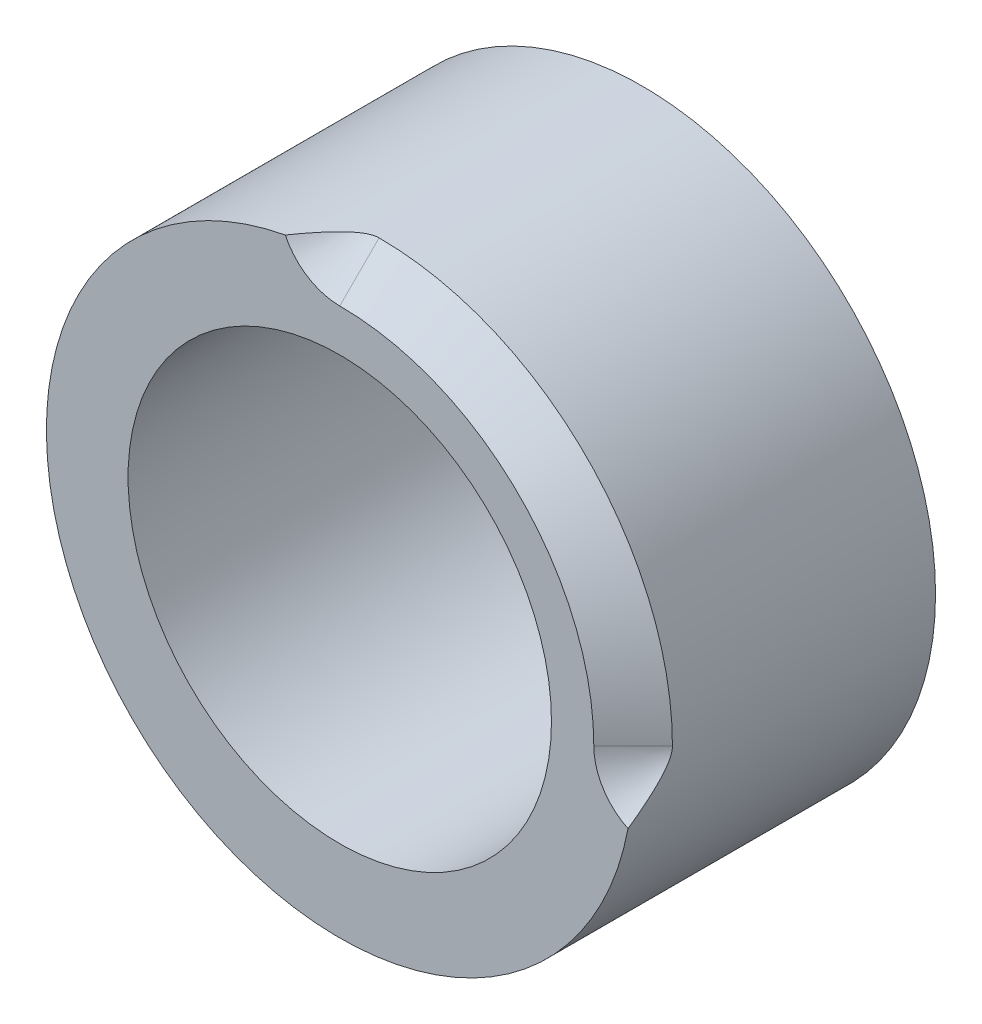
ISO-10303-21;
HEADER;
FILE_DESCRIPTION(('STEP AP214'),'2;1');
FILE_NAME('part.step','',(''),(''),'','','');
FILE_SCHEMA(('AUTOMOTIVE_DESIGN { 1 0 10303 214 1 1 1 1 }'));
ENDSEC;
DATA;
#1=APPLICATION_CONTEXT('core data for automotive mechanical design processes');
#2=APPLICATION_PROTOCOL_DEFINITION('international standard','automotive_design',2000,#1);
#3=PRODUCT_CONTEXT('',#1,'mechanical');
#4=PRODUCT('Part','Part','',(#3));
#5=PRODUCT_RELATED_PRODUCT_CATEGORY('part','',(#4));
#6=PRODUCT_DEFINITION_FORMATION('','',#4);
#7=PRODUCT_DEFINITION_CONTEXT('part definition',#1,'design');
#8=PRODUCT_DEFINITION('design','',#6,#7);
#9=PRODUCT_DEFINITION_SHAPE('','',#8);
#10=(LENGTH_UNIT() NAMED_UNIT(*) SI_UNIT(.MILLI.,.METRE.));
#11=(NAMED_UNIT(*) PLANE_ANGLE_UNIT() SI_UNIT($,.RADIAN.));
#12=(NAMED_UNIT(*) SI_UNIT($,.STERADIAN.) SOLID_ANGLE_UNIT());
#13=UNCERTAINTY_MEASURE_WITH_UNIT(LENGTH_MEASURE(1.E-05),#10,'distance_accuracy_value','');
#14=(GEOMETRIC_REPRESENTATION_CONTEXT(3) GLOBAL_UNCERTAINTY_ASSIGNED_CONTEXT((#13)) GLOBAL_UNIT_ASSIGNED_CONTEXT((#10,
#11,#12)) REPRESENTATION_CONTEXT('',''));
#15=CARTESIAN_POINT('',(0.,0.,0.));
#16=DIRECTION('',(0.,0.,1.));
#17=DIRECTION('',(1.,0.,0.));
#18=AXIS2_PLACEMENT_3D('',#15,#16,#17);
#19=CARTESIAN_POINT('',(0.,0.,-50.));
#20=DIRECTION('',(0.,0.,1.));
#21=DIRECTION('',(1.,0.,0.));
#22=AXIS2_PLACEMENT_3D('',#19,#20,#21);
#23=CYLINDRICAL_SURFACE('',#22,48.5);
#24=CARTESIAN_POINT('',(0.,0.,-50.));
#25=DIRECTION('',(0.,0.,1.));
#26=DIRECTION('',(1.,0.,0.));
#27=AXIS2_PLACEMENT_3D('',#24,#25,#26);
#28=CIRCLE('',#27,48.5);
#29=CARTESIAN_POINT('',(48.5,0.,-50.));
#30=VERTEX_POINT('',#29);
#31=EDGE_CURVE('E119',#30,#30,#28,.T.);
#32=ORIENTED_EDGE('',*,*,#31,.T.);
#33=EDGE_LOOP('',(#32));
#34=FACE_BOUND('',#33,.T.);
#35=CARTESIAN_POINT('',(0.,0.,0.));
#36=DIRECTION('',(0.,0.,1.));
#37=DIRECTION('',(1.,0.,0.));
#38=AXIS2_PLACEMENT_3D('',#35,#36,#37);
#39=CIRCLE('',#38,48.5);
#40=CARTESIAN_POINT('',(-9.00732124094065,47.65625,0.));
#41=VERTEX_POINT('',#40);
#42=CARTESIAN_POINT('',(47.65625,-9.00732124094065,0.));
#43=VERTEX_POINT('',#42);
#44=EDGE_CURVE('E122',#41,#43,#39,.T.);
#45=ORIENTED_EDGE('',*,*,#44,.F.);
#46=CARTESIAN_POINT('',(-9.00752473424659,47.6562115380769,0.0002));
#47=CARTESIAN_POINT('',(-8.85783923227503,47.6845032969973,-0.146912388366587));
#48=CARTESIAN_POINT('',(-8.70781815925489,47.7121288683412,-0.293810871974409));
#49=CARTESIAN_POINT('',(-8.40703516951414,47.766045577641,-0.587096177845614));
#50=CARTESIAN_POINT('',(-8.25627324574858,47.7923367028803,-0.733482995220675));
#51=CARTESIAN_POINT('',(-7.80263000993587,47.8692292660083,-1.17188698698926));
#52=CARTESIAN_POINT('',(-7.49853559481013,47.9178225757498,-1.46300552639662));
#53=CARTESIAN_POINT('',(-6.88153902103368,48.0103457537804,-2.04636058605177));
#54=CARTESIAN_POINT('',(-6.56857346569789,48.0541910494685,-2.33854370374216));
#55=CARTESIAN_POINT('',(-6.09500693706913,48.1157582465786,-2.77282094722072));
#56=CARTESIAN_POINT('',(-5.93649035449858,48.1355777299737,-2.91689141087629));
#57=CARTESIAN_POINT('',(-5.61779950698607,48.1738111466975,-3.20337106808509));
#58=CARTESIAN_POINT('',(-5.45762525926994,48.1922250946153,-3.34578027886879));
#59=CARTESIAN_POINT('',(-5.04517713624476,48.23753909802,-3.70758974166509));
#60=CARTESIAN_POINT('',(-4.79148428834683,48.2634270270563,-3.92551523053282));
#61=CARTESIAN_POINT('',(-4.40585472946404,48.299638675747,-4.24681813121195));
#62=CARTESIAN_POINT('',(-4.27640503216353,48.3112770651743,-4.35303375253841));
#63=CARTESIAN_POINT('',(-4.01550348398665,48.3336620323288,-4.56307398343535));
#64=CARTESIAN_POINT('',(-3.88405168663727,48.3444086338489,-4.66689865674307));
#65=CARTESIAN_POINT('',(-3.61918992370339,48.3649568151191,-4.87117098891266));
#66=CARTESIAN_POINT('',(-3.48578820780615,48.3747615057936,-4.97162899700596));
#67=CARTESIAN_POINT('',(-3.21605201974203,48.3934426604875,-5.16867864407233));
#68=CARTESIAN_POINT('',(-3.07971714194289,48.4023189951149,-5.26526974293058));
#69=CARTESIAN_POINT('',(-2.80369344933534,48.4190912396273,-5.45320714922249));
#70=CARTESIAN_POINT('',(-2.66400984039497,48.4269885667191,-5.54456093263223));
#71=CARTESIAN_POINT('',(-2.3803647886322,48.4417591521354,-5.72042478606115));
#72=CARTESIAN_POINT('',(-2.23640494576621,48.4486327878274,-5.80493737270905));
#73=CARTESIAN_POINT('',(-1.98080695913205,48.4596565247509,-5.94423046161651));
#74=CARTESIAN_POINT('',(-1.87031706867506,48.4640536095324,-6.00108766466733));
#75=CARTESIAN_POINT('',(-1.64612677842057,48.4721863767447,-6.10827973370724));
#76=CARTESIAN_POINT('',(-1.53242560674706,48.4759218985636,-6.15861301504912));
#77=CARTESIAN_POINT('',(-1.30246268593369,48.4826435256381,-6.25070903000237));
#78=CARTESIAN_POINT('',(-1.18622445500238,48.4856346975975,-6.29252933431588));
#79=CARTESIAN_POINT('',(-0.950594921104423,48.4908263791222,-6.36607461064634));
#80=CARTESIAN_POINT('',(-0.831205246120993,48.4930272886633,-6.39780468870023));
#81=CARTESIAN_POINT('',(-0.594266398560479,48.4964981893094,-6.44826627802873));
#82=CARTESIAN_POINT('',(-0.476814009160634,48.4977997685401,-6.46743747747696));
#83=CARTESIAN_POINT('',(-0.299131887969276,48.499114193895,-6.48685858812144));
#84=CARTESIAN_POINT('',(-0.239391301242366,48.4994460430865,-6.49177707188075));
#85=CARTESIAN_POINT('',(-0.119704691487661,48.4998892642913,-6.49835445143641));
#86=CARTESIAN_POINT('',(-0.0597585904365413,48.5000005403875,-6.50001192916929));
#87=CARTESIAN_POINT('',(0.000200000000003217,48.4999999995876,-6.49999999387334));
#88=B_SPLINE_CURVE_WITH_KNOTS('',3,(#46,#47,#48,#49,#50,#51,#52,#53,#54,#55,#56,#57,#58,#59,#60,
#61,#62,#63,#64,#65,#66,#67,#68,#69,#70,#71,#72,#73,#74,#75,#76,#77,#78,#79,#80,#81,#82,#83,#84,
#85,#86,#87),.UNSPECIFIED.,.F.,.F.,(4,2,2,2,2,2,2,2,2,2,2,2,2,2,2,2,2,2,2,2,4),(0.,
0.635319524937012,1.27064510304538,2.54190954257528,3.83300514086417,4.47834966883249,
5.12368749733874,6.12986790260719,6.63340179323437,7.13692224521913,7.6387179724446,
8.14058354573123,8.64171392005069,9.14265910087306,9.51550703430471,9.88844536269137,
10.2587710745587,10.6289090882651,10.9852761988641,11.165027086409,11.3448561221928),.UNSPECIFIED.);
#89=CARTESIAN_POINT('',(0.,48.5,-6.5));
#90=VERTEX_POINT('',#89);
#91=EDGE_CURVE('E56',#41,#90,#88,.T.);
#92=ORIENTED_EDGE('',*,*,#91,.T.);
#93=CARTESIAN_POINT('',(0.,0.,-6.5));
#94=DIRECTION('',(0.,0.,-1.));
#95=DIRECTION('',(-1.,0.,0.));
#96=AXIS2_PLACEMENT_3D('',#93,#94,#95);
#97=CIRCLE('',#96,48.5);
#98=CARTESIAN_POINT('',(48.5,0.,-6.5));
#99=VERTEX_POINT('',#98);
#100=EDGE_CURVE('E74',#90,#99,#97,.T.);
#101=ORIENTED_EDGE('',*,*,#100,.T.);
#102=CARTESIAN_POINT('',(47.6562115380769,-9.00752473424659,0.0002));
#103=CARTESIAN_POINT('',(47.6845032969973,-8.85783923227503,-0.146912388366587));
#104=CARTESIAN_POINT('',(47.7121288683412,-8.70781815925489,-0.293810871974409));
#105=CARTESIAN_POINT('',(47.766045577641,-8.40703516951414,-0.587096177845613));
#106=CARTESIAN_POINT('',(47.7923367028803,-8.25627324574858,-0.733482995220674));
#107=CARTESIAN_POINT('',(47.8692292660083,-7.80263000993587,-1.17188698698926));
#108=CARTESIAN_POINT('',(47.9178225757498,-7.49853559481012,-1.46300552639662));
#109=CARTESIAN_POINT('',(48.0103457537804,-6.88153902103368,-2.04636058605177));
#110=CARTESIAN_POINT('',(48.0541910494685,-6.5685734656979,-2.33854370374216));
#111=CARTESIAN_POINT('',(48.1157582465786,-6.09500693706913,-2.77282094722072));
#112=CARTESIAN_POINT('',(48.1355777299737,-5.93649035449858,-2.91689141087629));
#113=CARTESIAN_POINT('',(48.1738111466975,-5.61779950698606,-3.20337106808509));
#114=CARTESIAN_POINT('',(48.1922250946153,-5.45762525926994,-3.34578027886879));
#115=CARTESIAN_POINT('',(48.23753909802,-5.04517713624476,-3.70758974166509));
#116=CARTESIAN_POINT('',(48.2634270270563,-4.79148428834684,-3.92551523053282));
#117=CARTESIAN_POINT('',(48.299638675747,-4.40585472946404,-4.24681813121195));
#118=CARTESIAN_POINT('',(48.3112770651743,-4.27640503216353,-4.35303375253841));
#119=CARTESIAN_POINT('',(48.3336620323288,-4.01550348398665,-4.56307398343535));
#120=CARTESIAN_POINT('',(48.3444086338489,-3.88405168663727,-4.66689865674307));
#121=CARTESIAN_POINT('',(48.3649568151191,-3.61918992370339,-4.87117098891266));
#122=CARTESIAN_POINT('',(48.3747615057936,-3.48578820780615,-4.97162899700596));
#123=CARTESIAN_POINT('',(48.3934426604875,-3.21605201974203,-5.16867864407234));
#124=CARTESIAN_POINT('',(48.4023189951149,-3.07971714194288,-5.26526974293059));
#125=CARTESIAN_POINT('',(48.4190912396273,-2.80369344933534,-5.45320714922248));
#126=CARTESIAN_POINT('',(48.4269885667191,-2.66400984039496,-5.54456093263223));
#127=CARTESIAN_POINT('',(48.4417591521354,-2.38036478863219,-5.72042478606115));
#128=CARTESIAN_POINT('',(48.4486327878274,-2.23640494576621,-5.80493737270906));
#129=CARTESIAN_POINT('',(48.4596565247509,-1.98080695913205,-5.94423046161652));
#130=CARTESIAN_POINT('',(48.4640536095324,-1.87031706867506,-6.00108766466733));
#131=CARTESIAN_POINT('',(48.4721863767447,-1.64612677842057,-6.10827973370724));
#132=CARTESIAN_POINT('',(48.4759218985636,-1.53242560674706,-6.15861301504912));
#133=CARTESIAN_POINT('',(48.4826435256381,-1.30246268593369,-6.25070903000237));
#134=CARTESIAN_POINT('',(48.4856346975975,-1.18622445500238,-6.29252933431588));
#135=CARTESIAN_POINT('',(48.4908263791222,-0.950594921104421,-6.36607461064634));
#136=CARTESIAN_POINT('',(48.4930272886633,-0.831205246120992,-6.39780468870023));
#137=CARTESIAN_POINT('',(48.4964981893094,-0.594266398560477,-6.44826627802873));
#138=CARTESIAN_POINT('',(48.4977997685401,-0.476814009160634,-6.46743747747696));
#139=CARTESIAN_POINT('',(48.499114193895,-0.299131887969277,-6.48685858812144));
#140=CARTESIAN_POINT('',(48.4994460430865,-0.239391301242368,-6.49177707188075));
#141=CARTESIAN_POINT('',(48.4998892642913,-0.119704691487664,-6.49835445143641));
#142=CARTESIAN_POINT('',(48.5000005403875,-0.0597585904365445,-6.50001192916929));
#143=CARTESIAN_POINT('',(48.4999999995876,0.000199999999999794,-6.49999999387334));
#144=B_SPLINE_CURVE_WITH_KNOTS('',3,(#102,#103,#104,#105,#106,#107,#108,#109,#110,#111,#112,
#113,#114,#115,#116,#117,#118,#119,#120,#121,#122,#123,#124,#125,#126,#127,#128,#129,#130,#131,
#132,#133,#134,#135,#136,#137,#138,#139,#140,#141,#142,#143),.UNSPECIFIED.,.F.,.F.,(4,2,2,2,2,2,
2,2,2,2,2,2,2,2,2,2,2,2,2,2,4),(0.,0.635319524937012,1.27064510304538,2.54190954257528,
3.83300514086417,4.47834966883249,5.12368749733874,6.12986790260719,6.63340179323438,
7.13692224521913,7.6387179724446,8.14058354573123,8.6417139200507,9.14265910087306,
9.51550703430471,9.88844536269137,10.2587710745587,10.6289090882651,10.9852761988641,
11.165027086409,11.3448561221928),.UNSPECIFIED.);
#145=EDGE_CURVE('E66',#43,#99,#144,.T.);
#146=ORIENTED_EDGE('',*,*,#145,.F.);
#147=EDGE_LOOP('',(#45,#92,#101,#146));
#148=FACE_BOUND('',#147,.T.);
#149=ADVANCED_FACE('F33',(#34,#148),#23,.T.);
#150=CARTESIAN_POINT('',(0.,0.,0.));
#151=DIRECTION('',(0.,0.,1.));
#152=DIRECTION('',(1.,0.,0.));
#153=AXIS2_PLACEMENT_3D('',#150,#151,#152);
#154=PLANE('',#153);
#155=CARTESIAN_POINT('',(0.,0.,0.));
#156=DIRECTION('',(0.,0.,1.));
#157=DIRECTION('',(1.,0.,0.));
#158=AXIS2_PLACEMENT_3D('',#155,#156,#157);
#159=CIRCLE('',#158,35.);
#160=CARTESIAN_POINT('',(35.,0.,0.));
#161=VERTEX_POINT('',#160);
#162=EDGE_CURVE('E83',#161,#161,#159,.T.);
#163=ORIENTED_EDGE('',*,*,#162,.F.);
#164=EDGE_LOOP('',(#163));
#165=FACE_BOUND('',#164,.T.);
#166=CARTESIAN_POINT('',(0.,0.,0.));
#167=DIRECTION('',(0.,0.,1.));
#168=DIRECTION('',(1.,0.,0.));
#169=AXIS2_PLACEMENT_3D('',#166,#167,#168);
#170=CIRCLE('',#169,42.);
#171=CARTESIAN_POINT('',(42.,0.,0.));
#172=VERTEX_POINT('',#171);
#173=CARTESIAN_POINT('',(0.,42.,0.));
#174=VERTEX_POINT('',#173);
#175=EDGE_CURVE('E41',#172,#174,#170,.T.);
#176=ORIENTED_EDGE('',*,*,#175,.T.);
#177=CARTESIAN_POINT('',(0.,52.,0.));
#178=DIRECTION('',(0.,0.,1.));
#179=DIRECTION('',(1.,0.,0.));
#180=AXIS2_PLACEMENT_3D('',#177,#178,#179);
#181=CIRCLE('',#180,10.);
#182=EDGE_CURVE('E11',#174,#41,#181,.F.);
#183=ORIENTED_EDGE('',*,*,#182,.T.);
#184=ORIENTED_EDGE('',*,*,#44,.T.);
#185=CARTESIAN_POINT('',(52.,0.,0.));
#186=DIRECTION('',(0.,0.,1.));
#187=DIRECTION('',(1.,0.,0.));
#188=AXIS2_PLACEMENT_3D('',#185,#186,#187);
#189=CIRCLE('',#188,10.);
#190=EDGE_CURVE('E69',#172,#43,#189,.T.);
#191=ORIENTED_EDGE('',*,*,#190,.F.);
#192=EDGE_LOOP('',(#176,#183,#184,#191));
#193=FACE_BOUND('',#192,.T.);
#194=ADVANCED_FACE('F108',(#165,#193),#154,.T.);
#195=CARTESIAN_POINT('',(0.,0.,-50.));
#196=DIRECTION('',(0.,0.,1.));
#197=DIRECTION('',(1.,0.,0.));
#198=AXIS2_PLACEMENT_3D('',#195,#196,#197);
#199=PLANE('',#198);
#200=CARTESIAN_POINT('',(0.,0.,-50.));
#201=DIRECTION('',(0.,0.,1.));
#202=DIRECTION('',(1.,0.,0.));
#203=AXIS2_PLACEMENT_3D('',#200,#201,#202);
#204=CIRCLE('',#203,35.);
#205=CARTESIAN_POINT('',(35.,0.,-50.));
#206=VERTEX_POINT('',#205);
#207=EDGE_CURVE('E95',#206,#206,#204,.T.);
#208=ORIENTED_EDGE('',*,*,#207,.T.);
#209=EDGE_LOOP('',(#208));
#210=FACE_BOUND('',#209,.T.);
#211=ORIENTED_EDGE('',*,*,#31,.F.);
#212=EDGE_LOOP('',(#211));
#213=FACE_BOUND('',#212,.T.);
#214=ADVANCED_FACE('F105',(#210,#213),#199,.F.);
#215=CARTESIAN_POINT('',(0.,0.,-50.));
#216=DIRECTION('',(0.,0.,1.));
#217=DIRECTION('',(1.,0.,0.));
#218=AXIS2_PLACEMENT_3D('',#215,#216,#217);
#219=CYLINDRICAL_SURFACE('',#218,35.);
#220=ORIENTED_EDGE('',*,*,#207,.F.);
#221=EDGE_LOOP('',(#220));
#222=FACE_BOUND('',#221,.T.);
#223=ORIENTED_EDGE('',*,*,#162,.T.);
#224=EDGE_LOOP('',(#223));
#225=FACE_BOUND('',#224,.T.);
#226=ADVANCED_FACE('F102',(#222,#225),#219,.F.);
#227=CARTESIAN_POINT('',(0.,52.,10.));
#228=DIRECTION('',(0.,0.,1.));
#229=DIRECTION('',(1.,0.,0.));
#230=AXIS2_PLACEMENT_3D('',#227,#228,#229);
#231=CONICAL_SURFACE('',#230,20.,0.785398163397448);
#232=ORIENTED_EDGE('',*,*,#182,.F.);
#233=DIRECTION('',(0.,0.707106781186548,-0.707106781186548));
#234=VECTOR('',#233,1.);
#235=CARTESIAN_POINT('',(0.,32.,10.));
#236=LINE('',#235,#234);
#237=EDGE_CURVE('E75',#174,#90,#236,.T.);
#238=ORIENTED_EDGE('',*,*,#237,.T.);
#239=ORIENTED_EDGE('',*,*,#91,.F.);
#240=EDGE_LOOP('',(#232,#238,#239));
#241=FACE_BOUND('',#240,.T.);
#242=ADVANCED_FACE('F97',(#241),#231,.F.);
#243=CARTESIAN_POINT('',(0.,0.,10.));
#244=DIRECTION('',(0.,0.,-1.));
#245=DIRECTION('',(-1.,0.,0.));
#246=AXIS2_PLACEMENT_3D('',#243,#244,#245);
#247=CONICAL_SURFACE('',#246,32.,0.785398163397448);
#248=ORIENTED_EDGE('',*,*,#237,.F.);
#249=ORIENTED_EDGE('',*,*,#175,.F.);
#250=DIRECTION('',(0.707106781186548,0.,-0.707106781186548));
#251=VECTOR('',#250,1.);
#252=CARTESIAN_POINT('',(32.,0.,10.));
#253=LINE('',#252,#251);
#254=EDGE_CURVE('E48',#172,#99,#253,.T.);
#255=ORIENTED_EDGE('',*,*,#254,.T.);
#256=ORIENTED_EDGE('',*,*,#100,.F.);
#257=EDGE_LOOP('',(#248,#249,#255,#256));
#258=FACE_BOUND('',#257,.T.);
#259=ADVANCED_FACE('F79',(#258),#247,.T.);
#260=CARTESIAN_POINT('',(52.,0.,10.));
#261=DIRECTION('',(0.,0.,1.));
#262=DIRECTION('',(1.,0.,0.));
#263=AXIS2_PLACEMENT_3D('',#260,#261,#262);
#264=CONICAL_SURFACE('',#263,20.,0.785398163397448);
#265=ORIENTED_EDGE('',*,*,#145,.T.);
#266=ORIENTED_EDGE('',*,*,#254,.F.);
#267=ORIENTED_EDGE('',*,*,#190,.T.);
#268=EDGE_LOOP('',(#265,#266,#267));
#269=FACE_BOUND('',#268,.T.);
#270=ADVANCED_FACE('F67',(#269),#264,.F.);
#271=CLOSED_SHELL('',(#149,#194,#214,#226,#242,#259,#270));
#272=MANIFOLD_SOLID_BREP('B2',#271);
#273=ADVANCED_BREP_SHAPE_REPRESENTATION('',(#18,#272),#14);
#274=SHAPE_DEFINITION_REPRESENTATION(#9,#273);
ENDSEC;
END-ISO-10303-21;
